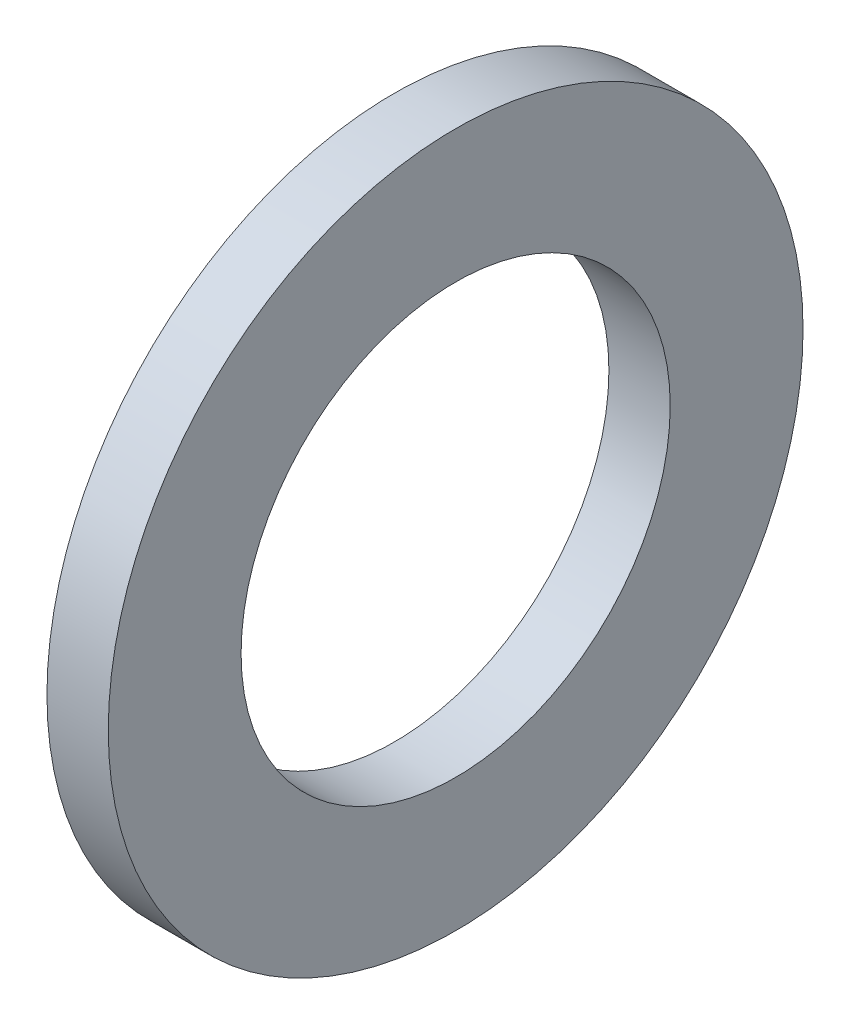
from build123d import *

# Parameters (mm, degrees)
SKETCH1_W = 3
SKETCH1_H = 6.5


with BuildPart() as part:
    # Sketch1 → Base-Revolve (revolve)
    with BuildSketch(Plane.XY, mode=Mode.PRIVATE) as base_revolve_sk:
        with Locations((-1.5, 13.75)):
            Rectangle(SKETCH1_W, SKETCH1_H)
    revolve(base_revolve_sk.sketch.rotate(Axis((-34.925, 0, 0), (1, 0, 0)), 90), axis=Axis((-34.925, 0, 0), (1, 0, 0)))


solid = part.part
